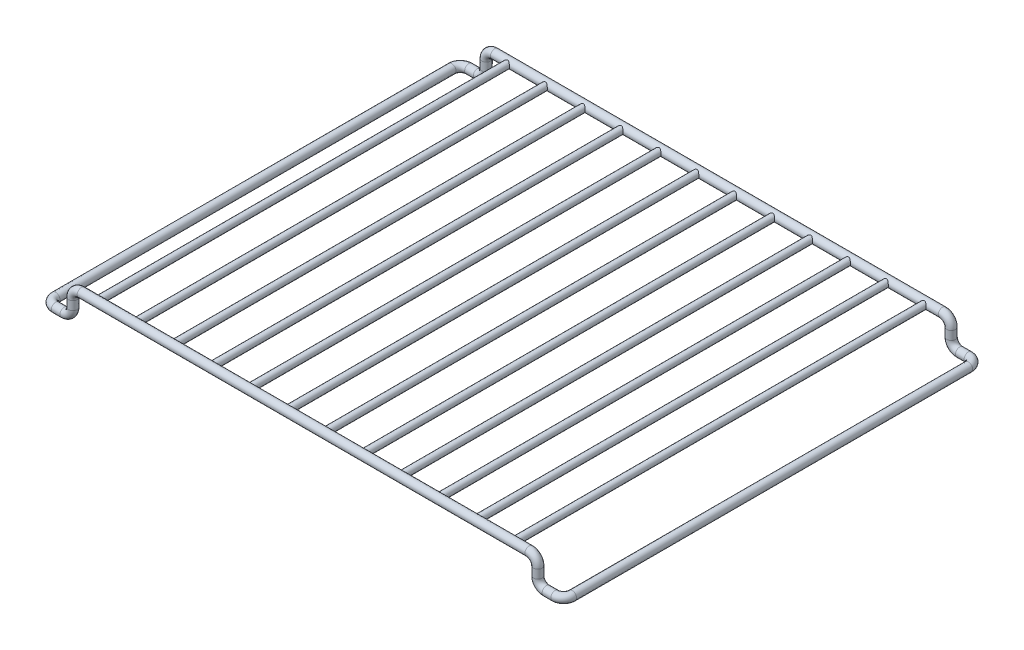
from build123d import *

# Parameters (mm, degrees)
SKIZZE1_R                    = 2.5
LINEAR_AUSTRAGEN1_REACH      = 289
LINEAR_AUSTRAGEN1_END_RADIUS = 2.5
SKIZZE2_R                    = 2
LINEARES_MUSTER2_COUNT       = 6
LINEARES_MUSTER2_PITCH       = 22


with BuildPart() as part:
    # Austragung1: sweep along a curve in space
    with BuildLine() as austragung1_path:
        Line((0, 0, 0), (130, 0, 0))
        ThreePointArc((130, 0, 0), (133.535533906, -1.464466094, 0), (135, -5, 0))
        Line((135, -5, 0), (135, -10, 0))
        ThreePointArc((135, -10, 0), (136.464466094, -13.535533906, 0), (140, -15, 0))
        Line((140, -15, 0), (145, -15, 0))
        ThreePointArc((145, -15, 0), (148.535533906, -15, 1.464466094), (150, -15, 5))
        Line((150, -15, 5), (150, -15, 235))
        ThreePointArc((145, -15, 240), (148.535533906, -15, 238.535533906), (150, -15, 235))
        Line((145, -15, 240), (140, -15, 240))
        ThreePointArc((140, -15, 240), (136.464466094, -13.535533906, 240), (135, -10, 240))
        Line((135, -10, 240), (135, -5, 240))
        ThreePointArc((135, -5, 240), (133.535533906, -1.464466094, 240), (130, 0, 240))
        Line((130, 0, 240), (0, 0, 240))
    # Skizze1 → Austragung1 (sweep)
    with BuildSketch(Plane(origin=(0, 0, 0), x_dir=(0, 0, -1), z_dir=(1, 0, 0))):
        Circle(SKIZZE1_R)
    sweep(path=austragung1_path.line)

    # Linear austragen1: up to this cylinder (the profile starts outside it)
    linear_austragen1_end = Plane(origin=(11, 0, 240), z_dir=(-1, 0, 0)) * Cylinder(LINEAR_AUSTRAGEN1_END_RADIUS, 584, mode=Mode.PRIVATE)
    # Skizze2 → Linear austragen1 (add, up to the surface)
    with BuildSketch(Plane.XY, mode=Mode.PRIVATE) as linear_austragen1_sk1:
        with Locations(Location((11, 0, 0), (0, 0, 180))):
            Circle(SKIZZE2_R)
    linear_austragen1_tool1 = extrude(linear_austragen1_sk1.sketch, amount=LINEAR_AUSTRAGEN1_REACH, mode=Mode.PRIVATE) - linear_austragen1_end
    linear_austragen1 = linear_austragen1_tool1.solids().sort_by_distance((11, 0, 0))[0]
    add(linear_austragen1)

    # Lineares Muster2: Linear austragen1 ×6
    with Locations(*[(i * LINEARES_MUSTER2_PITCH, 0, 0) for i in range(1, LINEARES_MUSTER2_COUNT)]):
        add(linear_austragen1)

    # Spiegeln1: part across plane


with BuildPart() as part_1:
    add(part.part)
    add(part.part.mirror(Plane(origin=(0, 0, 0), x_dir=(0, 0, 1), z_dir=(1, 0, 0))))


solid = part_1.part
